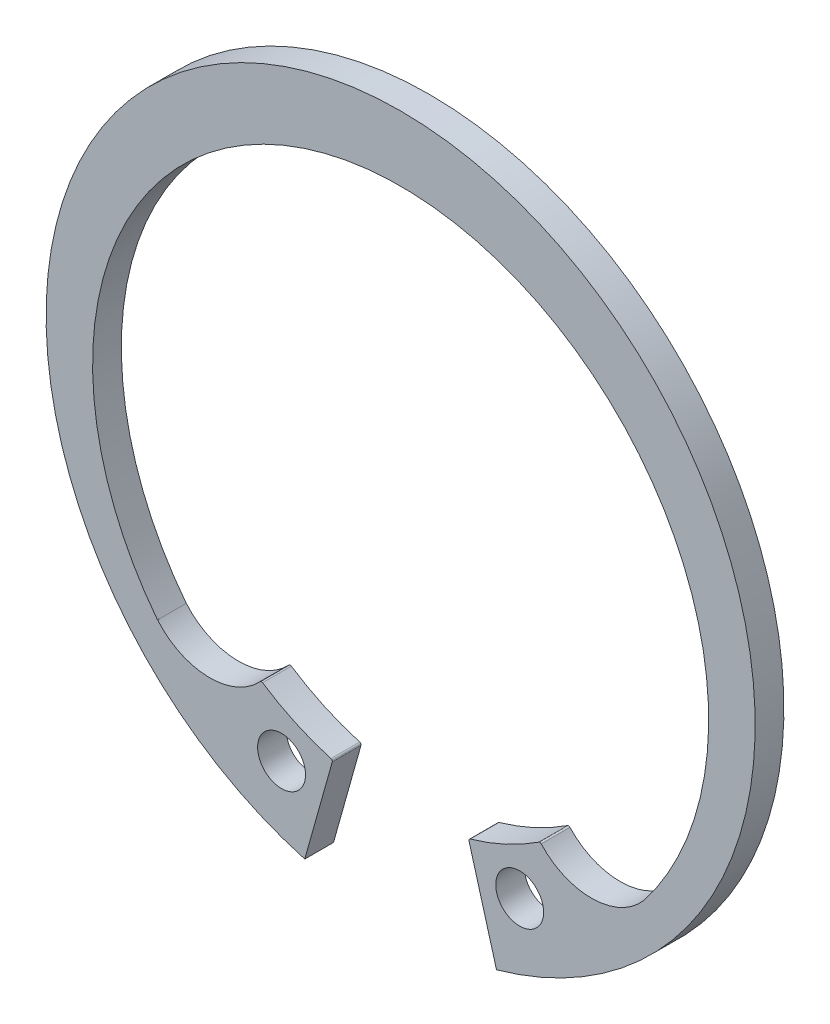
ISO-10303-21;
HEADER;
FILE_DESCRIPTION(('STEP AP214'),'2;1');
FILE_NAME('part.step','',(''),(''),'','','');
FILE_SCHEMA(('AUTOMOTIVE_DESIGN { 1 0 10303 214 1 1 1 1 }'));
ENDSEC;
DATA;
#1=APPLICATION_CONTEXT('core data for automotive mechanical design processes');
#2=APPLICATION_PROTOCOL_DEFINITION('international standard','automotive_design',2000,#1);
#3=PRODUCT_CONTEXT('',#1,'mechanical');
#4=PRODUCT('Part','Part','',(#3));
#5=PRODUCT_RELATED_PRODUCT_CATEGORY('part','',(#4));
#6=PRODUCT_DEFINITION_FORMATION('','',#4);
#7=PRODUCT_DEFINITION_CONTEXT('part definition',#1,'design');
#8=PRODUCT_DEFINITION('design','',#6,#7);
#9=PRODUCT_DEFINITION_SHAPE('','',#8);
#10=(LENGTH_UNIT() NAMED_UNIT(*) SI_UNIT(.MILLI.,.METRE.));
#11=(NAMED_UNIT(*) PLANE_ANGLE_UNIT() SI_UNIT($,.RADIAN.));
#12=(NAMED_UNIT(*) SI_UNIT($,.STERADIAN.) SOLID_ANGLE_UNIT());
#13=UNCERTAINTY_MEASURE_WITH_UNIT(LENGTH_MEASURE(1.E-05),#10,'distance_accuracy_value','');
#14=(GEOMETRIC_REPRESENTATION_CONTEXT(3) GLOBAL_UNCERTAINTY_ASSIGNED_CONTEXT((#13)) GLOBAL_UNIT_ASSIGNED_CONTEXT((#10,
#11,#12)) REPRESENTATION_CONTEXT('',''));
#15=CARTESIAN_POINT('',(0.,0.,0.));
#16=DIRECTION('',(0.,0.,1.));
#17=DIRECTION('',(1.,0.,0.));
#18=AXIS2_PLACEMENT_3D('',#15,#16,#17);
#19=CARTESIAN_POINT('',(0.,0.,-1.5));
#20=DIRECTION('',(0.,0.,1.));
#21=DIRECTION('',(1.,0.,0.));
#22=AXIS2_PLACEMENT_3D('',#19,#20,#21);
#23=CYLINDRICAL_SURFACE('',#22,18.5);
#24=CARTESIAN_POINT('',(0.,0.,-1.5));
#25=DIRECTION('',(0.,0.,1.));
#26=DIRECTION('',(1.,0.,0.));
#27=AXIS2_PLACEMENT_3D('',#24,#25,#26);
#28=CIRCLE('',#27,18.5);
#29=CARTESIAN_POINT('',(5.00274773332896,-17.8107415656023,-1.5));
#30=VERTEX_POINT('',#29);
#31=CARTESIAN_POINT('',(-5.00274773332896,-17.8107415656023,-1.5));
#32=VERTEX_POINT('',#31);
#33=EDGE_CURVE('E150',#30,#32,#28,.T.);
#34=ORIENTED_EDGE('',*,*,#33,.T.);
#35=DIRECTION('',(0.,0.,1.));
#36=VECTOR('',#35,1.);
#37=CARTESIAN_POINT('',(-5.00274773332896,-17.8107415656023,-1.5));
#38=LINE('',#37,#36);
#39=CARTESIAN_POINT('',(-5.00274773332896,-17.8107415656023,0.));
#40=VERTEX_POINT('',#39);
#41=EDGE_CURVE('E40',#32,#40,#38,.T.);
#42=ORIENTED_EDGE('',*,*,#41,.T.);
#43=CARTESIAN_POINT('',(0.,0.,0.));
#44=DIRECTION('',(0.,0.,1.));
#45=DIRECTION('',(1.,0.,0.));
#46=AXIS2_PLACEMENT_3D('',#43,#44,#45);
#47=CIRCLE('',#46,18.5);
#48=CARTESIAN_POINT('',(5.00274773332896,-17.8107415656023,0.));
#49=VERTEX_POINT('',#48);
#50=EDGE_CURVE('E61',#49,#40,#47,.T.);
#51=ORIENTED_EDGE('',*,*,#50,.F.);
#52=DIRECTION('',(0.,0.,1.));
#53=VECTOR('',#52,1.);
#54=CARTESIAN_POINT('',(5.00274773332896,-17.8107415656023,-1.5));
#55=LINE('',#54,#53);
#56=EDGE_CURVE('E11',#30,#49,#55,.T.);
#57=ORIENTED_EDGE('',*,*,#56,.F.);
#58=EDGE_LOOP('',(#34,#42,#51,#57));
#59=FACE_BOUND('',#58,.T.);
#60=ADVANCED_FACE('F37',(#59),#23,.T.);
#61=CARTESIAN_POINT('',(5.00274773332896,-17.8107415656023,-1.5));
#62=DIRECTION('',(-0.962742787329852,-0.270418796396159,0.));
#63=DIRECTION('',(0.270418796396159,-0.962742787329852,0.));
#64=AXIS2_PLACEMENT_3D('',#61,#62,#63);
#65=PLANE('',#64);
#66=DIRECTION('',(0.270418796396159,-0.962742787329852,0.));
#67=VECTOR('',#66,1.);
#68=CARTESIAN_POINT('',(5.00274773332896,-17.8107415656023,0.));
#69=LINE('',#68,#67);
#70=CARTESIAN_POINT('',(3.56942567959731,-12.7078401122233,0.));
#71=VERTEX_POINT('',#70);
#72=EDGE_CURVE('E253',#71,#49,#69,.T.);
#73=ORIENTED_EDGE('',*,*,#72,.F.);
#74=DIRECTION('',(0.,0.,1.));
#75=VECTOR('',#74,1.);
#76=CARTESIAN_POINT('',(3.56942567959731,-12.7078401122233,-1.5));
#77=LINE('',#76,#75);
#78=CARTESIAN_POINT('',(3.56942567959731,-12.7078401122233,-1.5));
#79=VERTEX_POINT('',#78);
#80=EDGE_CURVE('E226',#79,#71,#77,.T.);
#81=ORIENTED_EDGE('',*,*,#80,.F.);
#82=DIRECTION('',(0.270418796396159,-0.962742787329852,0.));
#83=VECTOR('',#82,1.);
#84=CARTESIAN_POINT('',(5.00274773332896,-17.8107415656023,-1.5));
#85=LINE('',#84,#83);
#86=EDGE_CURVE('E256',#79,#30,#85,.T.);
#87=ORIENTED_EDGE('',*,*,#86,.T.);
#88=ORIENTED_EDGE('',*,*,#56,.T.);
#89=EDGE_LOOP('',(#73,#81,#87,#88));
#90=FACE_BOUND('',#89,.T.);
#91=ADVANCED_FACE('F269',(#90),#65,.T.);
#92=CARTESIAN_POINT('',(0.,-0.973863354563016,-1.5));
#93=DIRECTION('',(0.,0.,1.));
#94=DIRECTION('',(1.,0.,0.));
#95=AXIS2_PLACEMENT_3D('',#92,#93,#94);
#96=CYLINDRICAL_SURFACE('',#95,16.073863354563);
#97=DIRECTION('',(0.,0.,1.));
#98=VECTOR('',#97,1.);
#99=CARTESIAN_POINT('',(-12.6854213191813,-10.8454979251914,-1.5));
#100=LINE('',#99,#98);
#101=CARTESIAN_POINT('',(-12.6854213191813,-10.8454979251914,-1.5));
#102=VERTEX_POINT('',#101);
#103=CARTESIAN_POINT('',(-12.6854213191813,-10.8454979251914,0.));
#104=VERTEX_POINT('',#103);
#105=EDGE_CURVE('E191',#102,#104,#100,.T.);
#106=ORIENTED_EDGE('',*,*,#105,.F.);
#107=CARTESIAN_POINT('',(0.,-0.973863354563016,-1.5));
#108=DIRECTION('',(0.,0.,-1.));
#109=DIRECTION('',(1.,0.,0.));
#110=AXIS2_PLACEMENT_3D('',#107,#108,#109);
#111=CIRCLE('',#110,16.073863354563);
#112=CARTESIAN_POINT('',(12.6854213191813,-10.8454979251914,-1.5));
#113=VERTEX_POINT('',#112);
#114=EDGE_CURVE('E69',#102,#113,#111,.T.);
#115=ORIENTED_EDGE('',*,*,#114,.T.);
#116=DIRECTION('',(0.,0.,1.));
#117=VECTOR('',#116,1.);
#118=CARTESIAN_POINT('',(12.6854213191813,-10.8454979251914,-1.5));
#119=LINE('',#118,#117);
#120=CARTESIAN_POINT('',(12.6854213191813,-10.8454979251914,0.));
#121=VERTEX_POINT('',#120);
#122=EDGE_CURVE('E229',#121,#113,#119,.F.);
#123=ORIENTED_EDGE('',*,*,#122,.F.);
#124=CARTESIAN_POINT('',(0.,-0.973863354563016,0.));
#125=DIRECTION('',(0.,0.,-1.));
#126=DIRECTION('',(1.,0.,0.));
#127=AXIS2_PLACEMENT_3D('',#124,#125,#126);
#128=CIRCLE('',#127,16.073863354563);
#129=EDGE_CURVE('E262',#104,#121,#128,.T.);
#130=ORIENTED_EDGE('',*,*,#129,.F.);
#131=EDGE_LOOP('',(#106,#115,#123,#130));
#132=FACE_BOUND('',#131,.T.);
#133=ADVANCED_FACE('F291',(#132),#96,.F.);
#134=CARTESIAN_POINT('',(-5.00274773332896,-17.8107415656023,-1.5));
#135=DIRECTION('',(0.962742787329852,-0.27041879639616,0.));
#136=DIRECTION('',(0.27041879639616,0.962742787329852,0.));
#137=AXIS2_PLACEMENT_3D('',#134,#135,#136);
#138=PLANE('',#137);
#139=DIRECTION('',(0.27041879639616,0.962742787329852,0.));
#140=VECTOR('',#139,1.);
#141=CARTESIAN_POINT('',(-5.00274773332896,-17.8107415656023,0.));
#142=LINE('',#141,#140);
#143=CARTESIAN_POINT('',(-3.56942567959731,-12.7078401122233,0.));
#144=VERTEX_POINT('',#143);
#145=EDGE_CURVE('E260',#40,#144,#142,.T.);
#146=ORIENTED_EDGE('',*,*,#145,.F.);
#147=ORIENTED_EDGE('',*,*,#41,.F.);
#148=DIRECTION('',(0.27041879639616,0.962742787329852,0.));
#149=VECTOR('',#148,1.);
#150=CARTESIAN_POINT('',(-5.00274773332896,-17.8107415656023,-1.5));
#151=LINE('',#150,#149);
#152=CARTESIAN_POINT('',(-3.56942567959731,-12.7078401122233,-1.5));
#153=VERTEX_POINT('',#152);
#154=EDGE_CURVE('E142',#32,#153,#151,.T.);
#155=ORIENTED_EDGE('',*,*,#154,.T.);
#156=DIRECTION('',(0.,0.,1.));
#157=VECTOR('',#156,1.);
#158=CARTESIAN_POINT('',(-3.56942567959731,-12.7078401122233,-1.5));
#159=LINE('',#158,#157);
#160=EDGE_CURVE('E146',#153,#144,#159,.T.);
#161=ORIENTED_EDGE('',*,*,#160,.T.);
#162=EDGE_LOOP('',(#146,#147,#155,#161));
#163=FACE_BOUND('',#162,.T.);
#164=ADVANCED_FACE('F145',(#163),#138,.T.);
#165=CARTESIAN_POINT('',(0.,0.,-1.5));
#166=DIRECTION('',(0.,0.,1.));
#167=DIRECTION('',(1.,0.,0.));
#168=AXIS2_PLACEMENT_3D('',#165,#166,#167);
#169=PLANE('',#168);
#170=ORIENTED_EDGE('',*,*,#114,.F.);
#171=DIRECTION('',(-0.760076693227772,-0.64983337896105,0.));
#172=VECTOR('',#171,1.);
#173=CARTESIAN_POINT('',(-14.0614188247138,-12.0219175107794,-1.5));
#174=LINE('',#173,#172);
#175=CARTESIAN_POINT('',(-12.6816952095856,-10.8423122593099,-1.5));
#176=VERTEX_POINT('',#175);
#177=EDGE_CURVE('E160',#176,#102,#174,.T.);
#178=ORIENTED_EDGE('',*,*,#177,.F.);
#179=CARTESIAN_POINT('',(-9.95700468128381,-8.51281726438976,-1.5));
#180=DIRECTION('',(0.,0.,-1.));
#181=DIRECTION('',(1.,0.,0.));
#182=AXIS2_PLACEMENT_3D('',#179,#180,#181);
#183=CIRCLE('',#182,3.58475737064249);
#184=CARTESIAN_POINT('',(-7.33356331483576,-10.9557746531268,-1.5));
#185=VERTEX_POINT('',#184);
#186=EDGE_CURVE('E177',#185,#176,#183,.T.);
#187=ORIENTED_EDGE('',*,*,#186,.F.);
#188=CARTESIAN_POINT('',(-7.26038008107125,-11.0239231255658,-1.5));
#189=DIRECTION('',(0.,0.,1.));
#190=DIRECTION('',(1.,0.,0.));
#191=AXIS2_PLACEMENT_3D('',#188,#189,#190);
#192=CIRCLE('',#191,0.0999999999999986);
#193=CARTESIAN_POINT('',(-7.2053772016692,-10.9404085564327,-1.5));
#194=VERTEX_POINT('',#193);
#195=EDGE_CURVE('E169',#194,#185,#192,.T.);
#196=ORIENTED_EDGE('',*,*,#195,.F.);
#197=CARTESIAN_POINT('',(0.,0.,-1.5));
#198=DIRECTION('',(0.,0.,-1.));
#199=DIRECTION('',(1.,0.,0.));
#200=AXIS2_PLACEMENT_3D('',#197,#198,#199);
#201=CIRCLE('',#200,13.1);
#202=CARTESIAN_POINT('',(-3.63792950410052,-12.5847315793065,-1.5));
#203=VERTEX_POINT('',#202);
#204=EDGE_CURVE('E165',#203,#194,#201,.T.);
#205=ORIENTED_EDGE('',*,*,#204,.F.);
#206=CARTESIAN_POINT('',(-3.66569995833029,-12.6807982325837,-1.5));
#207=DIRECTION('',(0.,0.,1.));
#208=DIRECTION('',(-1.,0.,0.));
#209=AXIS2_PLACEMENT_3D('',#206,#207,#208);
#210=CIRCLE('',#209,0.0999999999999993);
#211=EDGE_CURVE('E156',#153,#203,#210,.T.);
#212=ORIENTED_EDGE('',*,*,#211,.F.);
#213=ORIENTED_EDGE('',*,*,#154,.F.);
#214=ORIENTED_EDGE('',*,*,#33,.F.);
#215=ORIENTED_EDGE('',*,*,#86,.F.);
#216=CARTESIAN_POINT('',(3.66569995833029,-12.6807982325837,-1.5));
#217=DIRECTION('',(0.,0.,1.));
#218=DIRECTION('',(1.,0.,0.));
#219=AXIS2_PLACEMENT_3D('',#216,#217,#218);
#220=CIRCLE('',#219,0.0999999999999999);
#221=CARTESIAN_POINT('',(3.63792950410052,-12.5847315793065,-1.5));
#222=VERTEX_POINT('',#221);
#223=EDGE_CURVE('E211',#222,#79,#220,.T.);
#224=ORIENTED_EDGE('',*,*,#223,.F.);
#225=CARTESIAN_POINT('',(0.,0.,-1.5));
#226=DIRECTION('',(0.,0.,-1.));
#227=DIRECTION('',(1.,0.,0.));
#228=AXIS2_PLACEMENT_3D('',#225,#226,#227);
#229=CIRCLE('',#228,13.1);
#230=CARTESIAN_POINT('',(7.20537720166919,-10.9404085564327,-1.5));
#231=VERTEX_POINT('',#230);
#232=EDGE_CURVE('E209',#231,#222,#229,.T.);
#233=ORIENTED_EDGE('',*,*,#232,.F.);
#234=CARTESIAN_POINT('',(7.26038008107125,-11.0239231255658,-1.5));
#235=DIRECTION('',(0.,0.,1.));
#236=DIRECTION('',(-1.,0.,0.));
#237=AXIS2_PLACEMENT_3D('',#234,#235,#236);
#238=CIRCLE('',#237,0.0999999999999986);
#239=CARTESIAN_POINT('',(7.33356331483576,-10.9557746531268,-1.5));
#240=VERTEX_POINT('',#239);
#241=EDGE_CURVE('E206',#240,#231,#238,.T.);
#242=ORIENTED_EDGE('',*,*,#241,.F.);
#243=CARTESIAN_POINT('',(9.95700468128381,-8.51281726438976,-1.5));
#244=DIRECTION('',(0.,0.,-1.));
#245=DIRECTION('',(1.,0.,0.));
#246=AXIS2_PLACEMENT_3D('',#243,#244,#245);
#247=CIRCLE('',#246,3.58475737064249);
#248=CARTESIAN_POINT('',(12.6816952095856,-10.8423122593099,-1.5));
#249=VERTEX_POINT('',#248);
#250=EDGE_CURVE('E202',#249,#240,#247,.T.);
#251=ORIENTED_EDGE('',*,*,#250,.F.);
#252=DIRECTION('',(-0.760076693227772,0.64983337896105,0.));
#253=VECTOR('',#252,1.);
#254=CARTESIAN_POINT('',(12.6816952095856,-10.8423122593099,-1.5));
#255=LINE('',#254,#253);
#256=EDGE_CURVE('E200',#113,#249,#255,.T.);
#257=ORIENTED_EDGE('',*,*,#256,.F.);
#258=EDGE_LOOP('',(#170,#178,#187,#196,#205,#212,#213,#214,#215,#224,#233,#242,#251,#257));
#259=FACE_BOUND('',#258,.T.);
#260=CARTESIAN_POINT('',(6.2124461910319,-13.9819709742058,-1.5));
#261=DIRECTION('',(0.,0.,1.));
#262=DIRECTION('',(1.,0.,0.));
#263=AXIS2_PLACEMENT_3D('',#260,#261,#262);
#264=CIRCLE('',#263,1.25);
#265=CARTESIAN_POINT('',(7.4624461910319,-13.9819709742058,-1.5));
#266=VERTEX_POINT('',#265);
#267=EDGE_CURVE('E248',#266,#266,#264,.T.);
#268=ORIENTED_EDGE('',*,*,#267,.T.);
#269=EDGE_LOOP('',(#268));
#270=FACE_BOUND('',#269,.T.);
#271=CARTESIAN_POINT('',(-6.2124461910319,-13.9819709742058,-1.5));
#272=DIRECTION('',(0.,0.,1.));
#273=DIRECTION('',(1.,0.,0.));
#274=AXIS2_PLACEMENT_3D('',#271,#272,#273);
#275=CIRCLE('',#274,1.25);
#276=CARTESIAN_POINT('',(-4.9624461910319,-13.9819709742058,-1.5));
#277=VERTEX_POINT('',#276);
#278=EDGE_CURVE('E242',#277,#277,#275,.T.);
#279=ORIENTED_EDGE('',*,*,#278,.T.);
#280=EDGE_LOOP('',(#279));
#281=FACE_BOUND('',#280,.T.);
#282=ADVANCED_FACE('F162',(#259,#270,#281),#169,.F.);
#283=CARTESIAN_POINT('',(0.,0.,0.));
#284=DIRECTION('',(0.,0.,1.));
#285=DIRECTION('',(1.,0.,0.));
#286=AXIS2_PLACEMENT_3D('',#283,#284,#285);
#287=PLANE('',#286);
#288=DIRECTION('',(-0.760076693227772,-0.64983337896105,0.));
#289=VECTOR('',#288,1.);
#290=CARTESIAN_POINT('',(-14.0614188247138,-12.0219175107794,0.));
#291=LINE('',#290,#289);
#292=CARTESIAN_POINT('',(-12.6816952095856,-10.8423122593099,0.));
#293=VERTEX_POINT('',#292);
#294=EDGE_CURVE('E167',#293,#104,#291,.T.);
#295=ORIENTED_EDGE('',*,*,#294,.T.);
#296=ORIENTED_EDGE('',*,*,#129,.T.);
#297=DIRECTION('',(-0.760076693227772,0.64983337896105,0.));
#298=VECTOR('',#297,1.);
#299=CARTESIAN_POINT('',(12.6816952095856,-10.8423122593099,0.));
#300=LINE('',#299,#298);
#301=CARTESIAN_POINT('',(12.6816952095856,-10.8423122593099,0.));
#302=VERTEX_POINT('',#301);
#303=EDGE_CURVE('E199',#121,#302,#300,.T.);
#304=ORIENTED_EDGE('',*,*,#303,.T.);
#305=CARTESIAN_POINT('',(9.95700468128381,-8.51281726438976,0.));
#306=DIRECTION('',(0.,0.,-1.));
#307=DIRECTION('',(1.,0.,0.));
#308=AXIS2_PLACEMENT_3D('',#305,#306,#307);
#309=CIRCLE('',#308,3.58475737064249);
#310=CARTESIAN_POINT('',(7.33356331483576,-10.9557746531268,0.));
#311=VERTEX_POINT('',#310);
#312=EDGE_CURVE('E216',#302,#311,#309,.T.);
#313=ORIENTED_EDGE('',*,*,#312,.T.);
#314=CARTESIAN_POINT('',(7.26038008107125,-11.0239231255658,0.));
#315=DIRECTION('',(0.,0.,1.));
#316=DIRECTION('',(-1.,0.,0.));
#317=AXIS2_PLACEMENT_3D('',#314,#315,#316);
#318=CIRCLE('',#317,0.0999999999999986);
#319=CARTESIAN_POINT('',(7.20537720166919,-10.9404085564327,0.));
#320=VERTEX_POINT('',#319);
#321=EDGE_CURVE('E219',#311,#320,#318,.T.);
#322=ORIENTED_EDGE('',*,*,#321,.T.);
#323=CARTESIAN_POINT('',(0.,0.,0.));
#324=DIRECTION('',(0.,0.,-1.));
#325=DIRECTION('',(1.,0.,0.));
#326=AXIS2_PLACEMENT_3D('',#323,#324,#325);
#327=CIRCLE('',#326,13.1);
#328=CARTESIAN_POINT('',(3.63792950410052,-12.5847315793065,0.));
#329=VERTEX_POINT('',#328);
#330=EDGE_CURVE('E222',#320,#329,#327,.T.);
#331=ORIENTED_EDGE('',*,*,#330,.T.);
#332=CARTESIAN_POINT('',(3.66569995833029,-12.6807982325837,0.));
#333=DIRECTION('',(0.,0.,1.));
#334=DIRECTION('',(1.,0.,0.));
#335=AXIS2_PLACEMENT_3D('',#332,#333,#334);
#336=CIRCLE('',#335,0.0999999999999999);
#337=EDGE_CURVE('E203',#329,#71,#336,.T.);
#338=ORIENTED_EDGE('',*,*,#337,.T.);
#339=ORIENTED_EDGE('',*,*,#72,.T.);
#340=ORIENTED_EDGE('',*,*,#50,.T.);
#341=ORIENTED_EDGE('',*,*,#145,.T.);
#342=CARTESIAN_POINT('',(-3.66569995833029,-12.6807982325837,0.));
#343=DIRECTION('',(0.,0.,1.));
#344=DIRECTION('',(-1.,0.,0.));
#345=AXIS2_PLACEMENT_3D('',#342,#343,#344);
#346=CIRCLE('',#345,0.0999999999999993);
#347=CARTESIAN_POINT('',(-3.63792950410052,-12.5847315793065,0.));
#348=VERTEX_POINT('',#347);
#349=EDGE_CURVE('E158',#144,#348,#346,.T.);
#350=ORIENTED_EDGE('',*,*,#349,.T.);
#351=CARTESIAN_POINT('',(0.,0.,0.));
#352=DIRECTION('',(0.,0.,-1.));
#353=DIRECTION('',(1.,0.,0.));
#354=AXIS2_PLACEMENT_3D('',#351,#352,#353);
#355=CIRCLE('',#354,13.1);
#356=CARTESIAN_POINT('',(-7.2053772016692,-10.9404085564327,0.));
#357=VERTEX_POINT('',#356);
#358=EDGE_CURVE('E182',#348,#357,#355,.T.);
#359=ORIENTED_EDGE('',*,*,#358,.T.);
#360=CARTESIAN_POINT('',(-7.26038008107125,-11.0239231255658,0.));
#361=DIRECTION('',(0.,0.,1.));
#362=DIRECTION('',(1.,0.,0.));
#363=AXIS2_PLACEMENT_3D('',#360,#361,#362);
#364=CIRCLE('',#363,0.0999999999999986);
#365=CARTESIAN_POINT('',(-7.33356331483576,-10.9557746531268,0.));
#366=VERTEX_POINT('',#365);
#367=EDGE_CURVE('E184',#357,#366,#364,.T.);
#368=ORIENTED_EDGE('',*,*,#367,.T.);
#369=CARTESIAN_POINT('',(-9.95700468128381,-8.51281726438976,0.));
#370=DIRECTION('',(0.,0.,-1.));
#371=DIRECTION('',(1.,0.,0.));
#372=AXIS2_PLACEMENT_3D('',#369,#370,#371);
#373=CIRCLE('',#372,3.58475737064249);
#374=EDGE_CURVE('E172',#366,#293,#373,.T.);
#375=ORIENTED_EDGE('',*,*,#374,.T.);
#376=EDGE_LOOP('',(#295,#296,#304,#313,#322,#331,#338,#339,#340,#341,#350,#359,#368,#375));
#377=FACE_BOUND('',#376,.T.);
#378=CARTESIAN_POINT('',(6.2124461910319,-13.9819709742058,0.));
#379=DIRECTION('',(0.,0.,1.));
#380=DIRECTION('',(1.,0.,0.));
#381=AXIS2_PLACEMENT_3D('',#378,#379,#380);
#382=CIRCLE('',#381,1.25);
#383=CARTESIAN_POINT('',(7.4624461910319,-13.9819709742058,0.));
#384=VERTEX_POINT('',#383);
#385=EDGE_CURVE('E245',#384,#384,#382,.T.);
#386=ORIENTED_EDGE('',*,*,#385,.F.);
#387=EDGE_LOOP('',(#386));
#388=FACE_BOUND('',#387,.T.);
#389=CARTESIAN_POINT('',(-6.2124461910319,-13.9819709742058,0.));
#390=DIRECTION('',(0.,0.,1.));
#391=DIRECTION('',(1.,0.,0.));
#392=AXIS2_PLACEMENT_3D('',#389,#390,#391);
#393=CIRCLE('',#392,1.25);
#394=CARTESIAN_POINT('',(-4.9624461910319,-13.9819709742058,0.));
#395=VERTEX_POINT('',#394);
#396=EDGE_CURVE('E241',#395,#395,#393,.T.);
#397=ORIENTED_EDGE('',*,*,#396,.F.);
#398=EDGE_LOOP('',(#397));
#399=FACE_BOUND('',#398,.T.);
#400=ADVANCED_FACE('F264',(#377,#388,#399),#287,.T.);
#401=CARTESIAN_POINT('',(6.2124461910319,-13.9819709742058,-1.5));
#402=DIRECTION('',(0.,0.,1.));
#403=DIRECTION('',(1.,0.,0.));
#404=AXIS2_PLACEMENT_3D('',#401,#402,#403);
#405=CYLINDRICAL_SURFACE('',#404,1.25);
#406=ORIENTED_EDGE('',*,*,#267,.F.);
#407=EDGE_LOOP('',(#406));
#408=FACE_BOUND('',#407,.T.);
#409=ORIENTED_EDGE('',*,*,#385,.T.);
#410=EDGE_LOOP('',(#409));
#411=FACE_BOUND('',#410,.T.);
#412=ADVANCED_FACE('F314',(#408,#411),#405,.F.);
#413=CARTESIAN_POINT('',(-6.2124461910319,-13.9819709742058,-1.5));
#414=DIRECTION('',(0.,0.,1.));
#415=DIRECTION('',(1.,0.,0.));
#416=AXIS2_PLACEMENT_3D('',#413,#414,#415);
#417=CYLINDRICAL_SURFACE('',#416,1.25);
#418=ORIENTED_EDGE('',*,*,#278,.F.);
#419=EDGE_LOOP('',(#418));
#420=FACE_BOUND('',#419,.T.);
#421=ORIENTED_EDGE('',*,*,#396,.T.);
#422=EDGE_LOOP('',(#421));
#423=FACE_BOUND('',#422,.T.);
#424=ADVANCED_FACE('F307',(#420,#423),#417,.F.);
#425=CARTESIAN_POINT('',(0.,0.,-1.5));
#426=DIRECTION('',(0.,0.,1.));
#427=DIRECTION('',(1.,0.,0.));
#428=AXIS2_PLACEMENT_3D('',#425,#426,#427);
#429=CYLINDRICAL_SURFACE('',#428,13.1);
#430=ORIENTED_EDGE('',*,*,#330,.F.);
#431=DIRECTION('',(0.,0.,1.));
#432=VECTOR('',#431,1.);
#433=CARTESIAN_POINT('',(7.20537720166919,-10.9404085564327,-1.5));
#434=LINE('',#433,#432);
#435=EDGE_CURVE('E233',#231,#320,#434,.T.);
#436=ORIENTED_EDGE('',*,*,#435,.F.);
#437=ORIENTED_EDGE('',*,*,#232,.T.);
#438=DIRECTION('',(0.,0.,1.));
#439=VECTOR('',#438,1.);
#440=CARTESIAN_POINT('',(3.63792950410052,-12.5847315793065,-1.5));
#441=LINE('',#440,#439);
#442=EDGE_CURVE('E230',#222,#329,#441,.T.);
#443=ORIENTED_EDGE('',*,*,#442,.T.);
#444=EDGE_LOOP('',(#430,#436,#437,#443));
#445=FACE_BOUND('',#444,.T.);
#446=ADVANCED_FACE('F305',(#445),#429,.F.);
#447=CARTESIAN_POINT('',(3.66569995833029,-12.6807982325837,-1.5));
#448=DIRECTION('',(0.,0.,1.));
#449=DIRECTION('',(1.,0.,0.));
#450=AXIS2_PLACEMENT_3D('',#447,#448,#449);
#451=CYLINDRICAL_SURFACE('',#450,0.0999999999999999);
#452=ORIENTED_EDGE('',*,*,#337,.F.);
#453=ORIENTED_EDGE('',*,*,#442,.F.);
#454=ORIENTED_EDGE('',*,*,#223,.T.);
#455=ORIENTED_EDGE('',*,*,#80,.T.);
#456=EDGE_LOOP('',(#452,#453,#454,#455));
#457=FACE_BOUND('',#456,.T.);
#458=ADVANCED_FACE('F271',(#457),#451,.T.);
#459=CARTESIAN_POINT('',(7.26038008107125,-11.0239231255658,-1.5));
#460=DIRECTION('',(0.,0.,1.));
#461=DIRECTION('',(1.,0.,0.));
#462=AXIS2_PLACEMENT_3D('',#459,#460,#461);
#463=CYLINDRICAL_SURFACE('',#462,0.0999999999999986);
#464=ORIENTED_EDGE('',*,*,#321,.F.);
#465=DIRECTION('',(0.,0.,1.));
#466=VECTOR('',#465,1.);
#467=CARTESIAN_POINT('',(7.33356331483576,-10.9557746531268,-1.5));
#468=LINE('',#467,#466);
#469=EDGE_CURVE('E236',#240,#311,#468,.T.);
#470=ORIENTED_EDGE('',*,*,#469,.F.);
#471=ORIENTED_EDGE('',*,*,#241,.T.);
#472=ORIENTED_EDGE('',*,*,#435,.T.);
#473=EDGE_LOOP('',(#464,#470,#471,#472));
#474=FACE_BOUND('',#473,.T.);
#475=ADVANCED_FACE('F303',(#474),#463,.T.);
#476=CARTESIAN_POINT('',(9.95700468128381,-8.51281726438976,-1.5));
#477=DIRECTION('',(0.,0.,1.));
#478=DIRECTION('',(1.,0.,0.));
#479=AXIS2_PLACEMENT_3D('',#476,#477,#478);
#480=CYLINDRICAL_SURFACE('',#479,3.58475737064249);
#481=ORIENTED_EDGE('',*,*,#312,.F.);
#482=DIRECTION('',(0.,0.,1.));
#483=VECTOR('',#482,1.);
#484=CARTESIAN_POINT('',(12.6816952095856,-10.8423122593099,-1.5));
#485=LINE('',#484,#483);
#486=EDGE_CURVE('E214',#249,#302,#485,.T.);
#487=ORIENTED_EDGE('',*,*,#486,.F.);
#488=ORIENTED_EDGE('',*,*,#250,.T.);
#489=ORIENTED_EDGE('',*,*,#469,.T.);
#490=EDGE_LOOP('',(#481,#487,#488,#489));
#491=FACE_BOUND('',#490,.T.);
#492=ADVANCED_FACE('F300',(#491),#480,.F.);
#493=CARTESIAN_POINT('',(12.6816952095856,-10.8423122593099,-1.5));
#494=DIRECTION('',(0.64983337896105,0.760076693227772,0.));
#495=DIRECTION('',(-0.760076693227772,0.64983337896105,0.));
#496=AXIS2_PLACEMENT_3D('',#493,#494,#495);
#497=PLANE('',#496);
#498=ORIENTED_EDGE('',*,*,#303,.F.);
#499=ORIENTED_EDGE('',*,*,#122,.T.);
#500=ORIENTED_EDGE('',*,*,#256,.T.);
#501=ORIENTED_EDGE('',*,*,#486,.T.);
#502=EDGE_LOOP('',(#498,#499,#500,#501));
#503=FACE_BOUND('',#502,.T.);
#504=ADVANCED_FACE('F297',(#503),#497,.T.);
#505=CARTESIAN_POINT('',(0.,0.,-1.5));
#506=DIRECTION('',(0.,0.,1.));
#507=DIRECTION('',(1.,0.,0.));
#508=AXIS2_PLACEMENT_3D('',#505,#506,#507);
#509=CYLINDRICAL_SURFACE('',#508,13.1);
#510=ORIENTED_EDGE('',*,*,#358,.F.);
#511=DIRECTION('',(0.,0.,1.));
#512=VECTOR('',#511,1.);
#513=CARTESIAN_POINT('',(-3.63792950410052,-12.5847315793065,-1.5));
#514=LINE('',#513,#512);
#515=EDGE_CURVE('E159',#203,#348,#514,.T.);
#516=ORIENTED_EDGE('',*,*,#515,.F.);
#517=ORIENTED_EDGE('',*,*,#204,.T.);
#518=DIRECTION('',(0.,0.,1.));
#519=VECTOR('',#518,1.);
#520=CARTESIAN_POINT('',(-7.2053772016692,-10.9404085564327,-1.5));
#521=LINE('',#520,#519);
#522=EDGE_CURVE('E194',#194,#357,#521,.T.);
#523=ORIENTED_EDGE('',*,*,#522,.T.);
#524=EDGE_LOOP('',(#510,#516,#517,#523));
#525=FACE_BOUND('',#524,.T.);
#526=ADVANCED_FACE('F279',(#525),#509,.F.);
#527=CARTESIAN_POINT('',(-14.0614188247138,-12.0219175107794,-1.5));
#528=DIRECTION('',(-0.64983337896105,0.760076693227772,0.));
#529=DIRECTION('',(-0.760076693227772,-0.64983337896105,0.));
#530=AXIS2_PLACEMENT_3D('',#527,#528,#529);
#531=PLANE('',#530);
#532=ORIENTED_EDGE('',*,*,#177,.T.);
#533=ORIENTED_EDGE('',*,*,#105,.T.);
#534=ORIENTED_EDGE('',*,*,#294,.F.);
#535=DIRECTION('',(0.,0.,1.));
#536=VECTOR('',#535,1.);
#537=CARTESIAN_POINT('',(-12.6816952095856,-10.8423122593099,-1.5));
#538=LINE('',#537,#536);
#539=EDGE_CURVE('E189',#176,#293,#538,.T.);
#540=ORIENTED_EDGE('',*,*,#539,.F.);
#541=EDGE_LOOP('',(#532,#533,#534,#540));
#542=FACE_BOUND('',#541,.T.);
#543=ADVANCED_FACE('F289',(#542),#531,.T.);
#544=CARTESIAN_POINT('',(-9.95700468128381,-8.51281726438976,-1.5));
#545=DIRECTION('',(0.,0.,1.));
#546=DIRECTION('',(1.,0.,0.));
#547=AXIS2_PLACEMENT_3D('',#544,#545,#546);
#548=CYLINDRICAL_SURFACE('',#547,3.58475737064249);
#549=ORIENTED_EDGE('',*,*,#374,.F.);
#550=DIRECTION('',(0.,0.,1.));
#551=VECTOR('',#550,1.);
#552=CARTESIAN_POINT('',(-7.33356331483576,-10.9557746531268,-1.5));
#553=LINE('',#552,#551);
#554=EDGE_CURVE('E192',#185,#366,#553,.T.);
#555=ORIENTED_EDGE('',*,*,#554,.F.);
#556=ORIENTED_EDGE('',*,*,#186,.T.);
#557=ORIENTED_EDGE('',*,*,#539,.T.);
#558=EDGE_LOOP('',(#549,#555,#556,#557));
#559=FACE_BOUND('',#558,.T.);
#560=ADVANCED_FACE('F285',(#559),#548,.F.);
#561=CARTESIAN_POINT('',(-7.26038008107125,-11.0239231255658,-1.5));
#562=DIRECTION('',(0.,0.,1.));
#563=DIRECTION('',(1.,0.,0.));
#564=AXIS2_PLACEMENT_3D('',#561,#562,#563);
#565=CYLINDRICAL_SURFACE('',#564,0.0999999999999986);
#566=ORIENTED_EDGE('',*,*,#367,.F.);
#567=ORIENTED_EDGE('',*,*,#522,.F.);
#568=ORIENTED_EDGE('',*,*,#195,.T.);
#569=ORIENTED_EDGE('',*,*,#554,.T.);
#570=EDGE_LOOP('',(#566,#567,#568,#569));
#571=FACE_BOUND('',#570,.T.);
#572=ADVANCED_FACE('F281',(#571),#565,.T.);
#573=CARTESIAN_POINT('',(-3.66569995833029,-12.6807982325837,-1.5));
#574=DIRECTION('',(0.,0.,1.));
#575=DIRECTION('',(1.,0.,0.));
#576=AXIS2_PLACEMENT_3D('',#573,#574,#575);
#577=CYLINDRICAL_SURFACE('',#576,0.0999999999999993);
#578=ORIENTED_EDGE('',*,*,#349,.F.);
#579=ORIENTED_EDGE('',*,*,#160,.F.);
#580=ORIENTED_EDGE('',*,*,#211,.T.);
#581=ORIENTED_EDGE('',*,*,#515,.T.);
#582=EDGE_LOOP('',(#578,#579,#580,#581));
#583=FACE_BOUND('',#582,.T.);
#584=ADVANCED_FACE('F154',(#583),#577,.T.);
#585=CLOSED_SHELL('',(#60,#91,#133,#164,#282,#400,#412,#424,#446,#458,#475,#492,#504,#526,#543,
#560,#572,#584));
#586=MANIFOLD_SOLID_BREP('B2',#585);
#587=ADVANCED_BREP_SHAPE_REPRESENTATION('',(#18,#586),#14);
#588=SHAPE_DEFINITION_REPRESENTATION(#9,#587);
ENDSEC;
END-ISO-10303-21;
